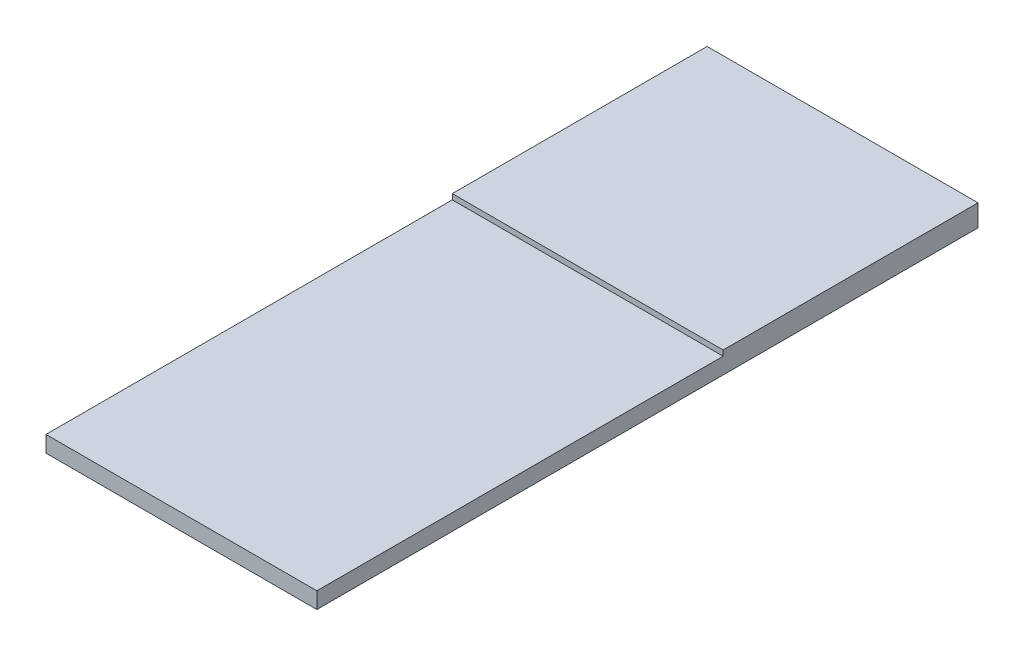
ISO-10303-21;
HEADER;
FILE_DESCRIPTION(('STEP AP214'),'2;1');
FILE_NAME('part.step','',(''),(''),'','','');
FILE_SCHEMA(('AUTOMOTIVE_DESIGN { 1 0 10303 214 1 1 1 1 }'));
ENDSEC;
DATA;
#1=APPLICATION_CONTEXT('core data for automotive mechanical design processes');
#2=APPLICATION_PROTOCOL_DEFINITION('international standard','automotive_design',2000,#1);
#3=PRODUCT_CONTEXT('',#1,'mechanical');
#4=PRODUCT('Part','Part','',(#3));
#5=PRODUCT_RELATED_PRODUCT_CATEGORY('part','',(#4));
#6=PRODUCT_DEFINITION_FORMATION('','',#4);
#7=PRODUCT_DEFINITION_CONTEXT('part definition',#1,'design');
#8=PRODUCT_DEFINITION('design','',#6,#7);
#9=PRODUCT_DEFINITION_SHAPE('','',#8);
#10=(LENGTH_UNIT() NAMED_UNIT(*) SI_UNIT(.MILLI.,.METRE.));
#11=(NAMED_UNIT(*) PLANE_ANGLE_UNIT() SI_UNIT($,.RADIAN.));
#12=(NAMED_UNIT(*) SI_UNIT($,.STERADIAN.) SOLID_ANGLE_UNIT());
#13=UNCERTAINTY_MEASURE_WITH_UNIT(LENGTH_MEASURE(1.E-05),#10,'distance_accuracy_value','');
#14=(GEOMETRIC_REPRESENTATION_CONTEXT(3) GLOBAL_UNCERTAINTY_ASSIGNED_CONTEXT((#13)) GLOBAL_UNIT_ASSIGNED_CONTEXT((#10,
#11,#12)) REPRESENTATION_CONTEXT('',''));
#15=CARTESIAN_POINT('',(0.,0.,0.));
#16=DIRECTION('',(0.,0.,1.));
#17=DIRECTION('',(1.,0.,0.));
#18=AXIS2_PLACEMENT_3D('',#15,#16,#17);
#19=CARTESIAN_POINT('',(0.,1.016,0.));
#20=DIRECTION('',(1.,0.,0.));
#21=DIRECTION('',(0.,0.,-1.));
#22=AXIS2_PLACEMENT_3D('',#19,#20,#21);
#23=PLANE('',#22);
#24=DIRECTION('',(0.,-1.,0.));
#25=VECTOR('',#24,1.);
#26=CARTESIAN_POINT('',(0.,1.016012,-19.05));
#27=LINE('',#26,#25);
#28=CARTESIAN_POINT('',(0.,1.016,-19.05));
#29=VERTEX_POINT('',#28);
#30=CARTESIAN_POINT('',(0.,0.762,-19.05));
#31=VERTEX_POINT('',#30);
#32=EDGE_CURVE('E117',#29,#31,#27,.T.);
#33=ORIENTED_EDGE('',*,*,#32,.F.);
#34=DIRECTION('',(0.,0.,1.));
#35=VECTOR('',#34,1.);
#36=CARTESIAN_POINT('',(0.,1.016,0.));
#37=LINE('',#36,#35);
#38=CARTESIAN_POINT('',(0.,1.016,-31.));
#39=VERTEX_POINT('',#38);
#40=EDGE_CURVE('E98',#39,#29,#37,.T.);
#41=ORIENTED_EDGE('',*,*,#40,.F.);
#42=DIRECTION('',(0.,-1.,0.));
#43=VECTOR('',#42,1.);
#44=CARTESIAN_POINT('',(0.,1.016,-31.));
#45=LINE('',#44,#43);
#46=CARTESIAN_POINT('',(0.,0.,-31.));
#47=VERTEX_POINT('',#46);
#48=EDGE_CURVE('E90',#39,#47,#45,.T.);
#49=ORIENTED_EDGE('',*,*,#48,.T.);
#50=DIRECTION('',(0.,0.,1.));
#51=VECTOR('',#50,1.);
#52=CARTESIAN_POINT('',(0.,0.,0.));
#53=LINE('',#52,#51);
#54=CARTESIAN_POINT('',(0.,0.,0.));
#55=VERTEX_POINT('',#54);
#56=EDGE_CURVE('E105',#47,#55,#53,.T.);
#57=ORIENTED_EDGE('',*,*,#56,.T.);
#58=DIRECTION('',(0.,-1.,0.));
#59=VECTOR('',#58,1.);
#60=CARTESIAN_POINT('',(0.,1.016,0.));
#61=LINE('',#60,#59);
#62=CARTESIAN_POINT('',(0.,0.762,0.));
#63=VERTEX_POINT('',#62);
#64=EDGE_CURVE('E53',#63,#55,#61,.T.);
#65=ORIENTED_EDGE('',*,*,#64,.F.);
#66=DIRECTION('',(0.,0.,1.));
#67=VECTOR('',#66,1.);
#68=CARTESIAN_POINT('',(0.,0.762,0.));
#69=LINE('',#68,#67);
#70=EDGE_CURVE('E139',#31,#63,#69,.T.);
#71=ORIENTED_EDGE('',*,*,#70,.F.);
#72=EDGE_LOOP('',(#33,#41,#49,#57,#65,#71));
#73=FACE_BOUND('',#72,.T.);
#74=ADVANCED_FACE('F45',(#73),#23,.F.);
#75=CARTESIAN_POINT('',(12.7,1.016,0.));
#76=DIRECTION('',(-1.,0.,0.));
#77=DIRECTION('',(0.,0.,1.));
#78=AXIS2_PLACEMENT_3D('',#75,#76,#77);
#79=PLANE('',#78);
#80=DIRECTION('',(0.,-1.,0.));
#81=VECTOR('',#80,1.);
#82=CARTESIAN_POINT('',(12.7,1.016012,-19.05));
#83=LINE('',#82,#81);
#84=CARTESIAN_POINT('',(12.7,1.016,-19.05));
#85=VERTEX_POINT('',#84);
#86=CARTESIAN_POINT('',(12.7,0.762,-19.05));
#87=VERTEX_POINT('',#86);
#88=EDGE_CURVE('E59',#85,#87,#83,.T.);
#89=ORIENTED_EDGE('',*,*,#88,.T.);
#90=DIRECTION('',(0.,0.,-1.));
#91=VECTOR('',#90,1.);
#92=CARTESIAN_POINT('',(12.7,0.762,0.));
#93=LINE('',#92,#91);
#94=CARTESIAN_POINT('',(12.7,0.762,0.));
#95=VERTEX_POINT('',#94);
#96=EDGE_CURVE('E163',#95,#87,#93,.T.);
#97=ORIENTED_EDGE('',*,*,#96,.F.);
#98=DIRECTION('',(0.,-1.,0.));
#99=VECTOR('',#98,1.);
#100=CARTESIAN_POINT('',(12.7,1.016,0.));
#101=LINE('',#100,#99);
#102=CARTESIAN_POINT('',(12.7,0.,0.));
#103=VERTEX_POINT('',#102);
#104=EDGE_CURVE('E126',#95,#103,#101,.T.);
#105=ORIENTED_EDGE('',*,*,#104,.T.);
#106=DIRECTION('',(0.,0.,-1.));
#107=VECTOR('',#106,1.);
#108=CARTESIAN_POINT('',(12.7,0.,0.));
#109=LINE('',#108,#107);
#110=CARTESIAN_POINT('',(12.7,0.,-31.));
#111=VERTEX_POINT('',#110);
#112=EDGE_CURVE('E99',#103,#111,#109,.T.);
#113=ORIENTED_EDGE('',*,*,#112,.T.);
#114=DIRECTION('',(0.,-1.,0.));
#115=VECTOR('',#114,1.);
#116=CARTESIAN_POINT('',(12.7,1.016,-31.));
#117=LINE('',#116,#115);
#118=CARTESIAN_POINT('',(12.7,1.016,-31.));
#119=VERTEX_POINT('',#118);
#120=EDGE_CURVE('E93',#119,#111,#117,.T.);
#121=ORIENTED_EDGE('',*,*,#120,.F.);
#122=DIRECTION('',(0.,0.,-1.));
#123=VECTOR('',#122,1.);
#124=CARTESIAN_POINT('',(12.7,1.016,0.));
#125=LINE('',#124,#123);
#126=EDGE_CURVE('E157',#85,#119,#125,.T.);
#127=ORIENTED_EDGE('',*,*,#126,.F.);
#128=EDGE_LOOP('',(#89,#97,#105,#113,#121,#127));
#129=FACE_BOUND('',#128,.T.);
#130=ADVANCED_FACE('F172',(#129),#79,.F.);
#131=CARTESIAN_POINT('',(0.,1.016,0.));
#132=DIRECTION('',(0.,-1.,0.));
#133=DIRECTION('',(0.,0.,-1.));
#134=AXIS2_PLACEMENT_3D('',#131,#132,#133);
#135=PLANE('',#134);
#136=DIRECTION('',(-1.,0.,0.));
#137=VECTOR('',#136,1.);
#138=CARTESIAN_POINT('',(0.,1.016,-19.05));
#139=LINE('',#138,#137);
#140=EDGE_CURVE('E11',#85,#29,#139,.T.);
#141=ORIENTED_EDGE('',*,*,#140,.F.);
#142=ORIENTED_EDGE('',*,*,#126,.T.);
#143=DIRECTION('',(-1.,0.,0.));
#144=VECTOR('',#143,1.);
#145=CARTESIAN_POINT('',(0.,1.016,-31.));
#146=LINE('',#145,#144);
#147=EDGE_CURVE('E68',#119,#39,#146,.T.);
#148=ORIENTED_EDGE('',*,*,#147,.T.);
#149=ORIENTED_EDGE('',*,*,#40,.T.);
#150=EDGE_LOOP('',(#141,#142,#148,#149));
#151=FACE_BOUND('',#150,.T.);
#152=ADVANCED_FACE('F155',(#151),#135,.F.);
#153=CARTESIAN_POINT('',(0.,1.016,0.));
#154=DIRECTION('',(0.,0.,-1.));
#155=DIRECTION('',(-1.,0.,0.));
#156=AXIS2_PLACEMENT_3D('',#153,#154,#155);
#157=PLANE('',#156);
#158=ORIENTED_EDGE('',*,*,#104,.F.);
#159=DIRECTION('',(1.,0.,0.));
#160=VECTOR('',#159,1.);
#161=CARTESIAN_POINT('',(0.,0.762,0.));
#162=LINE('',#161,#160);
#163=EDGE_CURVE('E135',#63,#95,#162,.T.);
#164=ORIENTED_EDGE('',*,*,#163,.F.);
#165=ORIENTED_EDGE('',*,*,#64,.T.);
#166=DIRECTION('',(1.,0.,0.));
#167=VECTOR('',#166,1.);
#168=CARTESIAN_POINT('',(0.,0.,0.));
#169=LINE('',#168,#167);
#170=EDGE_CURVE('E111',#55,#103,#169,.T.);
#171=ORIENTED_EDGE('',*,*,#170,.T.);
#172=EDGE_LOOP('',(#158,#164,#165,#171));
#173=FACE_BOUND('',#172,.T.);
#174=ADVANCED_FACE('F132',(#173),#157,.F.);
#175=CARTESIAN_POINT('',(0.,1.016,-31.));
#176=DIRECTION('',(0.,0.,1.));
#177=DIRECTION('',(1.,0.,0.));
#178=AXIS2_PLACEMENT_3D('',#175,#176,#177);
#179=PLANE('',#178);
#180=DIRECTION('',(-1.,0.,0.));
#181=VECTOR('',#180,1.);
#182=CARTESIAN_POINT('',(0.,0.,-31.));
#183=LINE('',#182,#181);
#184=EDGE_CURVE('E87',#111,#47,#183,.T.);
#185=ORIENTED_EDGE('',*,*,#184,.T.);
#186=ORIENTED_EDGE('',*,*,#48,.F.);
#187=ORIENTED_EDGE('',*,*,#147,.F.);
#188=ORIENTED_EDGE('',*,*,#120,.T.);
#189=EDGE_LOOP('',(#185,#186,#187,#188));
#190=FACE_BOUND('',#189,.T.);
#191=ADVANCED_FACE('F89',(#190),#179,.F.);
#192=CARTESIAN_POINT('',(0.,0.,0.));
#193=DIRECTION('',(0.,-1.,0.));
#194=DIRECTION('',(0.,0.,-1.));
#195=AXIS2_PLACEMENT_3D('',#192,#193,#194);
#196=PLANE('',#195);
#197=ORIENTED_EDGE('',*,*,#56,.F.);
#198=ORIENTED_EDGE('',*,*,#184,.F.);
#199=ORIENTED_EDGE('',*,*,#112,.F.);
#200=ORIENTED_EDGE('',*,*,#170,.F.);
#201=EDGE_LOOP('',(#197,#198,#199,#200));
#202=FACE_BOUND('',#201,.T.);
#203=ADVANCED_FACE('F109',(#202),#196,.T.);
#204=CARTESIAN_POINT('',(0.,1.016012,-19.05));
#205=DIRECTION('',(0.,0.,1.));
#206=DIRECTION('',(1.,0.,0.));
#207=AXIS2_PLACEMENT_3D('',#204,#205,#206);
#208=PLANE('',#207);
#209=ORIENTED_EDGE('',*,*,#140,.T.);
#210=ORIENTED_EDGE('',*,*,#32,.T.);
#211=DIRECTION('',(-1.,0.,0.));
#212=VECTOR('',#211,1.);
#213=CARTESIAN_POINT('',(0.,0.762,-19.05));
#214=LINE('',#213,#212);
#215=EDGE_CURVE('E153',#87,#31,#214,.T.);
#216=ORIENTED_EDGE('',*,*,#215,.F.);
#217=ORIENTED_EDGE('',*,*,#88,.F.);
#218=EDGE_LOOP('',(#209,#210,#216,#217));
#219=FACE_BOUND('',#218,.T.);
#220=ADVANCED_FACE('F150',(#219),#208,.T.);
#221=CARTESIAN_POINT('',(0.,0.762,0.));
#222=DIRECTION('',(0.,-1.,0.));
#223=DIRECTION('',(0.,0.,-1.));
#224=AXIS2_PLACEMENT_3D('',#221,#222,#223);
#225=PLANE('',#224);
#226=ORIENTED_EDGE('',*,*,#70,.T.);
#227=ORIENTED_EDGE('',*,*,#163,.T.);
#228=ORIENTED_EDGE('',*,*,#96,.T.);
#229=ORIENTED_EDGE('',*,*,#215,.T.);
#230=EDGE_LOOP('',(#226,#227,#228,#229));
#231=FACE_BOUND('',#230,.T.);
#232=ADVANCED_FACE('F170',(#231),#225,.F.);
#233=CLOSED_SHELL('',(#74,#130,#152,#174,#191,#203,#220,#232));
#234=MANIFOLD_SOLID_BREP('B2',#233);
#235=ADVANCED_BREP_SHAPE_REPRESENTATION('',(#18,#234),#14);
#236=SHAPE_DEFINITION_REPRESENTATION(#9,#235);
ENDSEC;
END-ISO-10303-21;
